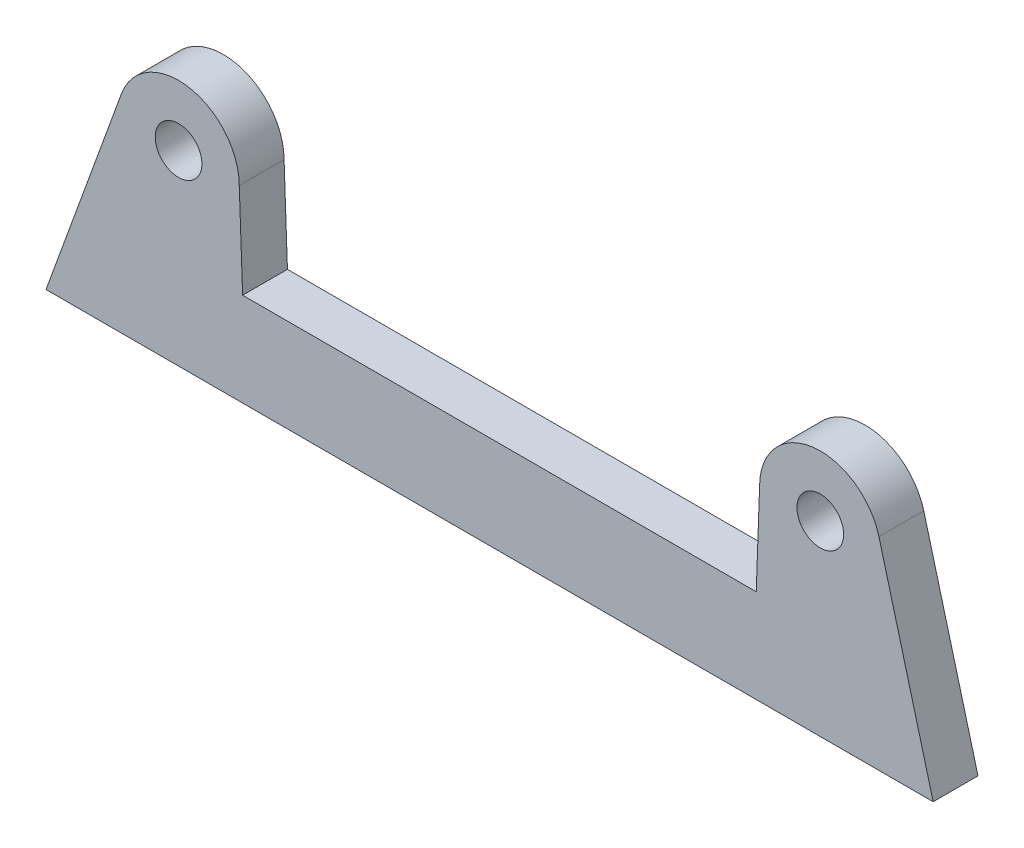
ISO-10303-21;
HEADER;
FILE_DESCRIPTION(('STEP AP214'),'2;1');
FILE_NAME('part.step','',(''),(''),'','','');
FILE_SCHEMA(('AUTOMOTIVE_DESIGN { 1 0 10303 214 1 1 1 1 }'));
ENDSEC;
DATA;
#1=APPLICATION_CONTEXT('core data for automotive mechanical design processes');
#2=APPLICATION_PROTOCOL_DEFINITION('international standard','automotive_design',2000,#1);
#3=PRODUCT_CONTEXT('',#1,'mechanical');
#4=PRODUCT('Part','Part','',(#3));
#5=PRODUCT_RELATED_PRODUCT_CATEGORY('part','',(#4));
#6=PRODUCT_DEFINITION_FORMATION('','',#4);
#7=PRODUCT_DEFINITION_CONTEXT('part definition',#1,'design');
#8=PRODUCT_DEFINITION('design','',#6,#7);
#9=PRODUCT_DEFINITION_SHAPE('','',#8);
#10=(LENGTH_UNIT() NAMED_UNIT(*) SI_UNIT(.MILLI.,.METRE.));
#11=(NAMED_UNIT(*) PLANE_ANGLE_UNIT() SI_UNIT($,.RADIAN.));
#12=(NAMED_UNIT(*) SI_UNIT($,.STERADIAN.) SOLID_ANGLE_UNIT());
#13=UNCERTAINTY_MEASURE_WITH_UNIT(LENGTH_MEASURE(1.E-05),#10,'distance_accuracy_value','');
#14=(GEOMETRIC_REPRESENTATION_CONTEXT(3) GLOBAL_UNCERTAINTY_ASSIGNED_CONTEXT((#13)) GLOBAL_UNIT_ASSIGNED_CONTEXT((#10,
#11,#12)) REPRESENTATION_CONTEXT('',''));
#15=CARTESIAN_POINT('',(0.,0.,0.));
#16=DIRECTION('',(0.,0.,1.));
#17=DIRECTION('',(1.,0.,0.));
#18=AXIS2_PLACEMENT_3D('',#15,#16,#17);
#19=CARTESIAN_POINT('',(10.2694788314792,28.2151611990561,-1154.21041919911));
#20=DIRECTION('',(-0.939692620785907,0.342020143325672,0.));
#21=DIRECTION('',(-0.342020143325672,-0.939692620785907,0.));
#22=AXIS2_PLACEMENT_3D('',#19,#20,#21);
#23=PLANE('',#22);
#24=DIRECTION('',(-0.342020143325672,-0.939692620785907,0.));
#25=VECTOR('',#24,1.);
#26=CARTESIAN_POINT('',(10.2694788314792,28.2151611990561,-1160.30641919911));
#27=LINE('',#26,#25);
#28=CARTESIAN_POINT('',(10.2694788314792,28.2151611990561,-1160.30641919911));
#29=VERTEX_POINT('',#28);
#30=CARTESIAN_POINT('',(0.,0.,-1160.30641919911));
#31=VERTEX_POINT('',#30);
#32=EDGE_CURVE('E131',#29,#31,#27,.T.);
#33=ORIENTED_EDGE('',*,*,#32,.T.);
#34=DIRECTION('',(0.,0.,-1.));
#35=VECTOR('',#34,1.);
#36=CARTESIAN_POINT('',(0.,0.,-1154.21041919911));
#37=LINE('',#36,#35);
#38=CARTESIAN_POINT('',(0.,0.,-1154.21041919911));
#39=VERTEX_POINT('',#38);
#40=EDGE_CURVE('E38',#39,#31,#37,.T.);
#41=ORIENTED_EDGE('',*,*,#40,.F.);
#42=DIRECTION('',(-0.342020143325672,-0.939692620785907,0.));
#43=VECTOR('',#42,1.);
#44=CARTESIAN_POINT('',(10.2694788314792,28.2151611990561,-1154.21041919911));
#45=LINE('',#44,#43);
#46=CARTESIAN_POINT('',(10.2694788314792,28.2151611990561,-1154.21041919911));
#47=VERTEX_POINT('',#46);
#48=EDGE_CURVE('E145',#47,#39,#45,.T.);
#49=ORIENTED_EDGE('',*,*,#48,.F.);
#50=DIRECTION('',(0.,0.,-1.));
#51=VECTOR('',#50,1.);
#52=CARTESIAN_POINT('',(10.2694788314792,28.2151611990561,-1154.21041919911));
#53=LINE('',#52,#51);
#54=EDGE_CURVE('E11',#47,#29,#53,.T.);
#55=ORIENTED_EDGE('',*,*,#54,.T.);
#56=EDGE_LOOP('',(#33,#41,#49,#55));
#57=FACE_BOUND('',#56,.T.);
#58=ADVANCED_FACE('F35',(#57),#23,.T.);
#59=CARTESIAN_POINT('',(18.0266414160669,25.3917849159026,-1154.21041919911));
#60=DIRECTION('',(0.,0.,-1.));
#61=DIRECTION('',(1.,0.,0.));
#62=AXIS2_PLACEMENT_3D('',#59,#60,#61);
#63=CYLINDRICAL_SURFACE('',#62,8.255);
#64=CARTESIAN_POINT('',(18.0266414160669,25.3917849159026,-1160.30641919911));
#65=DIRECTION('',(0.,0.,1.));
#66=DIRECTION('',(-1.,0.,0.));
#67=AXIS2_PLACEMENT_3D('',#64,#65,#66);
#68=CIRCLE('',#67,8.255);
#69=CARTESIAN_POINT('',(26.2816414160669,25.3917849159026,-1160.30641919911));
#70=VERTEX_POINT('',#69);
#71=EDGE_CURVE('E88',#70,#29,#68,.T.);
#72=ORIENTED_EDGE('',*,*,#71,.T.);
#73=ORIENTED_EDGE('',*,*,#54,.F.);
#74=CARTESIAN_POINT('',(18.0266414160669,25.3917849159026,-1154.21041919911));
#75=DIRECTION('',(0.,0.,1.));
#76=DIRECTION('',(-1.,0.,0.));
#77=AXIS2_PLACEMENT_3D('',#74,#75,#76);
#78=CIRCLE('',#77,8.255);
#79=CARTESIAN_POINT('',(26.2816414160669,25.3917849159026,-1154.21041919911));
#80=VERTEX_POINT('',#79);
#81=EDGE_CURVE('E53',#80,#47,#78,.T.);
#82=ORIENTED_EDGE('',*,*,#81,.F.);
#83=DIRECTION('',(0.,0.,-1.));
#84=VECTOR('',#83,1.);
#85=CARTESIAN_POINT('',(26.2816414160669,25.3917849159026,-1154.21041919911));
#86=LINE('',#85,#84);
#87=EDGE_CURVE('E44',#80,#70,#86,.T.);
#88=ORIENTED_EDGE('',*,*,#87,.T.);
#89=EDGE_LOOP('',(#72,#73,#82,#88));
#90=FACE_BOUND('',#89,.T.);
#91=ADVANCED_FACE('F214',(#90),#63,.T.);
#92=CARTESIAN_POINT('',(26.7383641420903,12.7,-1154.21041919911));
#93=DIRECTION('',(0.99935314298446,0.0359624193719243,0.));
#94=DIRECTION('',(-0.0359624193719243,0.99935314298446,0.));
#95=AXIS2_PLACEMENT_3D('',#92,#93,#94);
#96=PLANE('',#95);
#97=DIRECTION('',(-0.0359624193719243,0.99935314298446,0.));
#98=VECTOR('',#97,1.);
#99=CARTESIAN_POINT('',(26.7383641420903,12.7,-1160.30641919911));
#100=LINE('',#99,#98);
#101=CARTESIAN_POINT('',(26.7383641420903,12.7,-1160.30641919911));
#102=VERTEX_POINT('',#101);
#103=EDGE_CURVE('E82',#102,#70,#100,.T.);
#104=ORIENTED_EDGE('',*,*,#103,.T.);
#105=ORIENTED_EDGE('',*,*,#87,.F.);
#106=DIRECTION('',(-0.0359624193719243,0.99935314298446,0.));
#107=VECTOR('',#106,1.);
#108=CARTESIAN_POINT('',(26.7383641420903,12.7,-1154.21041919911));
#109=LINE('',#108,#107);
#110=CARTESIAN_POINT('',(26.7383641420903,12.7,-1154.21041919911));
#111=VERTEX_POINT('',#110);
#112=EDGE_CURVE('E113',#111,#80,#109,.T.);
#113=ORIENTED_EDGE('',*,*,#112,.F.);
#114=DIRECTION('',(0.,0.,-1.));
#115=VECTOR('',#114,1.);
#116=CARTESIAN_POINT('',(26.7383641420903,12.7,-1154.21041919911));
#117=LINE('',#116,#115);
#118=EDGE_CURVE('E120',#111,#102,#117,.T.);
#119=ORIENTED_EDGE('',*,*,#118,.T.);
#120=EDGE_LOOP('',(#104,#105,#113,#119));
#121=FACE_BOUND('',#120,.T.);
#122=ADVANCED_FACE('F126',(#121),#96,.T.);
#123=CARTESIAN_POINT('',(96.5883641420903,12.7,-1154.21041919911));
#124=DIRECTION('',(0.,1.,0.));
#125=DIRECTION('',(0.,0.,-1.));
#126=AXIS2_PLACEMENT_3D('',#123,#124,#125);
#127=PLANE('',#126);
#128=DIRECTION('',(-1.,0.,0.));
#129=VECTOR('',#128,1.);
#130=CARTESIAN_POINT('',(96.5883641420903,12.7,-1160.30641919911));
#131=LINE('',#130,#129);
#132=CARTESIAN_POINT('',(96.5883641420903,12.7,-1160.30641919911));
#133=VERTEX_POINT('',#132);
#134=EDGE_CURVE('E123',#133,#102,#131,.T.);
#135=ORIENTED_EDGE('',*,*,#134,.T.);
#136=ORIENTED_EDGE('',*,*,#118,.F.);
#137=DIRECTION('',(-1.,0.,0.));
#138=VECTOR('',#137,1.);
#139=CARTESIAN_POINT('',(96.5883641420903,12.7,-1154.21041919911));
#140=LINE('',#139,#138);
#141=CARTESIAN_POINT('',(96.5883641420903,12.7,-1154.21041919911));
#142=VERTEX_POINT('',#141);
#143=EDGE_CURVE('E109',#142,#111,#140,.T.);
#144=ORIENTED_EDGE('',*,*,#143,.F.);
#145=DIRECTION('',(0.,0.,-1.));
#146=VECTOR('',#145,1.);
#147=CARTESIAN_POINT('',(96.5883641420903,12.7,-1154.21041919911));
#148=LINE('',#147,#146);
#149=EDGE_CURVE('E124',#142,#133,#148,.T.);
#150=ORIENTED_EDGE('',*,*,#149,.T.);
#151=EDGE_LOOP('',(#135,#136,#144,#150));
#152=FACE_BOUND('',#151,.T.);
#153=ADVANCED_FACE('F121',(#152),#127,.T.);
#154=CARTESIAN_POINT('',(97.0450868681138,25.3917849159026,-1154.21041919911));
#155=DIRECTION('',(-0.99935314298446,0.0359624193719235,0.));
#156=DIRECTION('',(-0.0359624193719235,-0.99935314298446,0.));
#157=AXIS2_PLACEMENT_3D('',#154,#155,#156);
#158=PLANE('',#157);
#159=DIRECTION('',(-0.0359624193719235,-0.99935314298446,0.));
#160=VECTOR('',#159,1.);
#161=CARTESIAN_POINT('',(97.0450868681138,25.3917849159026,-1160.30641919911));
#162=LINE('',#161,#160);
#163=CARTESIAN_POINT('',(97.0450868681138,25.3917849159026,-1160.30641919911));
#164=VERTEX_POINT('',#163);
#165=EDGE_CURVE('E141',#164,#133,#162,.T.);
#166=ORIENTED_EDGE('',*,*,#165,.T.);
#167=ORIENTED_EDGE('',*,*,#149,.F.);
#168=DIRECTION('',(-0.0359624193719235,-0.99935314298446,0.));
#169=VECTOR('',#168,1.);
#170=CARTESIAN_POINT('',(97.0450868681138,25.3917849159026,-1154.21041919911));
#171=LINE('',#170,#169);
#172=CARTESIAN_POINT('',(97.0450868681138,25.3917849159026,-1154.21041919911));
#173=VERTEX_POINT('',#172);
#174=EDGE_CURVE('E115',#173,#142,#171,.T.);
#175=ORIENTED_EDGE('',*,*,#174,.F.);
#176=DIRECTION('',(0.,0.,-1.));
#177=VECTOR('',#176,1.);
#178=CARTESIAN_POINT('',(97.0450868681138,25.3917849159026,-1154.21041919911));
#179=LINE('',#178,#177);
#180=EDGE_CURVE('E149',#173,#164,#179,.T.);
#181=ORIENTED_EDGE('',*,*,#180,.T.);
#182=EDGE_LOOP('',(#166,#167,#175,#181));
#183=FACE_BOUND('',#182,.T.);
#184=ADVANCED_FACE('F225',(#183),#158,.T.);
#185=CARTESIAN_POINT('',(105.300086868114,25.3917849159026,-1154.21041919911));
#186=DIRECTION('',(0.,0.,-1.));
#187=DIRECTION('',(1.,0.,0.));
#188=AXIS2_PLACEMENT_3D('',#185,#186,#187);
#189=CYLINDRICAL_SURFACE('',#188,8.255);
#190=CARTESIAN_POINT('',(105.300086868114,25.3917849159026,-1160.30641919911));
#191=DIRECTION('',(0.,0.,1.));
#192=DIRECTION('',(1.,0.,0.));
#193=AXIS2_PLACEMENT_3D('',#190,#191,#192);
#194=CIRCLE('',#193,8.255);
#195=CARTESIAN_POINT('',(113.27380456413,27.528336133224,-1160.30641919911));
#196=VERTEX_POINT('',#195);
#197=EDGE_CURVE('E139',#196,#164,#194,.T.);
#198=ORIENTED_EDGE('',*,*,#197,.T.);
#199=ORIENTED_EDGE('',*,*,#180,.F.);
#200=CARTESIAN_POINT('',(105.300086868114,25.3917849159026,-1154.21041919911));
#201=DIRECTION('',(0.,0.,1.));
#202=DIRECTION('',(1.,0.,0.));
#203=AXIS2_PLACEMENT_3D('',#200,#201,#202);
#204=CIRCLE('',#203,8.255);
#205=CARTESIAN_POINT('',(113.27380456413,27.528336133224,-1154.21041919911));
#206=VERTEX_POINT('',#205);
#207=EDGE_CURVE('E174',#206,#173,#204,.T.);
#208=ORIENTED_EDGE('',*,*,#207,.F.);
#209=DIRECTION('',(0.,0.,-1.));
#210=VECTOR('',#209,1.);
#211=CARTESIAN_POINT('',(113.27380456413,27.528336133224,-1154.21041919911));
#212=LINE('',#211,#210);
#213=EDGE_CURVE('E152',#206,#196,#212,.T.);
#214=ORIENTED_EDGE('',*,*,#213,.T.);
#215=EDGE_LOOP('',(#198,#199,#208,#214));
#216=FACE_BOUND('',#215,.T.);
#217=ADVANCED_FACE('F172',(#216),#189,.T.);
#218=CARTESIAN_POINT('',(120.65,0.,-1154.21041919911));
#219=DIRECTION('',(0.965925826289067,0.258819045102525,0.));
#220=DIRECTION('',(-0.258819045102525,0.965925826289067,0.));
#221=AXIS2_PLACEMENT_3D('',#218,#219,#220);
#222=PLANE('',#221);
#223=DIRECTION('',(-0.258819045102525,0.965925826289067,0.));
#224=VECTOR('',#223,1.);
#225=CARTESIAN_POINT('',(120.65,0.,-1160.30641919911));
#226=LINE('',#225,#224);
#227=CARTESIAN_POINT('',(120.65,0.,-1160.30641919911));
#228=VERTEX_POINT('',#227);
#229=EDGE_CURVE('E137',#228,#196,#226,.T.);
#230=ORIENTED_EDGE('',*,*,#229,.T.);
#231=ORIENTED_EDGE('',*,*,#213,.F.);
#232=DIRECTION('',(-0.258819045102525,0.965925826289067,0.));
#233=VECTOR('',#232,1.);
#234=CARTESIAN_POINT('',(120.65,0.,-1154.21041919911));
#235=LINE('',#234,#233);
#236=CARTESIAN_POINT('',(120.65,0.,-1154.21041919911));
#237=VERTEX_POINT('',#236);
#238=EDGE_CURVE('E175',#237,#206,#235,.T.);
#239=ORIENTED_EDGE('',*,*,#238,.F.);
#240=DIRECTION('',(0.,0.,-1.));
#241=VECTOR('',#240,1.);
#242=CARTESIAN_POINT('',(120.65,0.,-1154.21041919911));
#243=LINE('',#242,#241);
#244=EDGE_CURVE('E154',#237,#228,#243,.T.);
#245=ORIENTED_EDGE('',*,*,#244,.T.);
#246=EDGE_LOOP('',(#230,#231,#239,#245));
#247=FACE_BOUND('',#246,.T.);
#248=ADVANCED_FACE('F169',(#247),#222,.T.);
#249=CARTESIAN_POINT('',(0.,0.,-1154.21041919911));
#250=DIRECTION('',(0.,-1.,0.));
#251=DIRECTION('',(0.,0.,1.));
#252=AXIS2_PLACEMENT_3D('',#249,#250,#251);
#253=PLANE('',#252);
#254=DIRECTION('',(1.,0.,0.));
#255=VECTOR('',#254,1.);
#256=CARTESIAN_POINT('',(0.,0.,-1160.30641919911));
#257=LINE('',#256,#255);
#258=EDGE_CURVE('E134',#31,#228,#257,.T.);
#259=ORIENTED_EDGE('',*,*,#258,.T.);
#260=ORIENTED_EDGE('',*,*,#244,.F.);
#261=DIRECTION('',(1.,0.,0.));
#262=VECTOR('',#261,1.);
#263=CARTESIAN_POINT('',(0.,0.,-1154.21041919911));
#264=LINE('',#263,#262);
#265=EDGE_CURVE('E96',#39,#237,#264,.T.);
#266=ORIENTED_EDGE('',*,*,#265,.F.);
#267=ORIENTED_EDGE('',*,*,#40,.T.);
#268=EDGE_LOOP('',(#259,#260,#266,#267));
#269=FACE_BOUND('',#268,.T.);
#270=ADVANCED_FACE('F160',(#269),#253,.T.);
#271=CARTESIAN_POINT('',(105.300086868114,25.3917849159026,-1154.21041919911));
#272=DIRECTION('',(0.,0.,-1.));
#273=DIRECTION('',(1.,0.,0.));
#274=AXIS2_PLACEMENT_3D('',#271,#272,#273);
#275=PLANE('',#274);
#276=CARTESIAN_POINT('',(105.300086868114,25.3917849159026,-1154.21041919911));
#277=DIRECTION('',(0.,0.,1.));
#278=DIRECTION('',(1.,0.,0.));
#279=AXIS2_PLACEMENT_3D('',#276,#277,#278);
#280=CIRCLE('',#279,3.175);
#281=CARTESIAN_POINT('',(108.475086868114,25.3917849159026,-1154.21041919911));
#282=VERTEX_POINT('',#281);
#283=EDGE_CURVE('E184',#282,#282,#280,.T.);
#284=ORIENTED_EDGE('',*,*,#283,.F.);
#285=EDGE_LOOP('',(#284));
#286=FACE_BOUND('',#285,.T.);
#287=CARTESIAN_POINT('',(18.0266414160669,25.3917849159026,-1154.21041919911));
#288=DIRECTION('',(0.,0.,1.));
#289=DIRECTION('',(1.,0.,0.));
#290=AXIS2_PLACEMENT_3D('',#287,#288,#289);
#291=CIRCLE('',#290,3.175);
#292=CARTESIAN_POINT('',(21.2016414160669,25.3917849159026,-1154.21041919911));
#293=VERTEX_POINT('',#292);
#294=EDGE_CURVE('E135',#293,#293,#291,.T.);
#295=ORIENTED_EDGE('',*,*,#294,.F.);
#296=EDGE_LOOP('',(#295));
#297=FACE_BOUND('',#296,.T.);
#298=ORIENTED_EDGE('',*,*,#48,.T.);
#299=ORIENTED_EDGE('',*,*,#265,.T.);
#300=ORIENTED_EDGE('',*,*,#238,.T.);
#301=ORIENTED_EDGE('',*,*,#207,.T.);
#302=ORIENTED_EDGE('',*,*,#174,.T.);
#303=ORIENTED_EDGE('',*,*,#143,.T.);
#304=ORIENTED_EDGE('',*,*,#112,.T.);
#305=ORIENTED_EDGE('',*,*,#81,.T.);
#306=EDGE_LOOP('',(#298,#299,#300,#301,#302,#303,#304,#305));
#307=FACE_BOUND('',#306,.T.);
#308=ADVANCED_FACE('F111',(#286,#297,#307),#275,.F.);
#309=CARTESIAN_POINT('',(105.300086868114,25.3917849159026,-1160.30641919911));
#310=DIRECTION('',(0.,0.,-1.));
#311=DIRECTION('',(1.,0.,0.));
#312=AXIS2_PLACEMENT_3D('',#309,#310,#311);
#313=PLANE('',#312);
#314=CARTESIAN_POINT('',(105.300086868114,25.3917849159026,-1160.30641919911));
#315=DIRECTION('',(0.,0.,1.));
#316=DIRECTION('',(1.,0.,0.));
#317=AXIS2_PLACEMENT_3D('',#314,#315,#316);
#318=CIRCLE('',#317,3.175);
#319=CARTESIAN_POINT('',(108.475086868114,25.3917849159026,-1160.30641919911));
#320=VERTEX_POINT('',#319);
#321=EDGE_CURVE('E187',#320,#320,#318,.T.);
#322=ORIENTED_EDGE('',*,*,#321,.T.);
#323=EDGE_LOOP('',(#322));
#324=FACE_BOUND('',#323,.T.);
#325=CARTESIAN_POINT('',(18.0266414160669,25.3917849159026,-1160.30641919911));
#326=DIRECTION('',(0.,0.,1.));
#327=DIRECTION('',(1.,0.,0.));
#328=AXIS2_PLACEMENT_3D('',#325,#326,#327);
#329=CIRCLE('',#328,3.175);
#330=CARTESIAN_POINT('',(21.2016414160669,25.3917849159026,-1160.30641919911));
#331=VERTEX_POINT('',#330);
#332=EDGE_CURVE('E181',#331,#331,#329,.T.);
#333=ORIENTED_EDGE('',*,*,#332,.T.);
#334=EDGE_LOOP('',(#333));
#335=FACE_BOUND('',#334,.T.);
#336=ORIENTED_EDGE('',*,*,#32,.F.);
#337=ORIENTED_EDGE('',*,*,#71,.F.);
#338=ORIENTED_EDGE('',*,*,#103,.F.);
#339=ORIENTED_EDGE('',*,*,#134,.F.);
#340=ORIENTED_EDGE('',*,*,#165,.F.);
#341=ORIENTED_EDGE('',*,*,#197,.F.);
#342=ORIENTED_EDGE('',*,*,#229,.F.);
#343=ORIENTED_EDGE('',*,*,#258,.F.);
#344=EDGE_LOOP('',(#336,#337,#338,#339,#340,#341,#342,#343));
#345=FACE_BOUND('',#344,.T.);
#346=ADVANCED_FACE('F165',(#324,#335,#345),#313,.T.);
#347=CARTESIAN_POINT('',(18.0266414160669,25.3917849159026,-1154.21041919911));
#348=DIRECTION('',(0.,0.,-1.));
#349=DIRECTION('',(1.,0.,0.));
#350=AXIS2_PLACEMENT_3D('',#347,#348,#349);
#351=CYLINDRICAL_SURFACE('',#350,3.175);
#352=CARTESIAN_POINT('',(21.2016414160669,25.3917849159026,-1154.21041919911));
#353=CARTESIAN_POINT('',(21.2016414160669,25.3917849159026,-1154.27391919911));
#354=CARTESIAN_POINT('',(21.2016414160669,25.3917849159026,-1154.33741919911));
#355=CARTESIAN_POINT('',(21.2016414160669,25.3917849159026,-1154.46441919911));
#356=CARTESIAN_POINT('',(21.2016414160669,25.3917849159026,-1154.52791919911));
#357=CARTESIAN_POINT('',(21.2016414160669,25.3917849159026,-1154.65491919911));
#358=CARTESIAN_POINT('',(21.2016414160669,25.3917849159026,-1154.71841919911));
#359=CARTESIAN_POINT('',(21.2016414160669,25.3917849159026,-1154.84541919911));
#360=CARTESIAN_POINT('',(21.2016414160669,25.3917849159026,-1154.90891919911));
#361=CARTESIAN_POINT('',(21.2016414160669,25.3917849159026,-1155.03591919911));
#362=CARTESIAN_POINT('',(21.2016414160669,25.3917849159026,-1155.09941919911));
#363=CARTESIAN_POINT('',(21.2016414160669,25.3917849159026,-1155.22641919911));
#364=CARTESIAN_POINT('',(21.2016414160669,25.3917849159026,-1155.28991919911));
#365=CARTESIAN_POINT('',(21.2016414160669,25.3917849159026,-1155.41691919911));
#366=CARTESIAN_POINT('',(21.2016414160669,25.3917849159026,-1155.48041919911));
#367=CARTESIAN_POINT('',(21.2016414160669,25.3917849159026,-1155.60741919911));
#368=CARTESIAN_POINT('',(21.2016414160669,25.3917849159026,-1155.67091919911));
#369=CARTESIAN_POINT('',(21.2016414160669,25.3917849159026,-1155.79791919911));
#370=CARTESIAN_POINT('',(21.2016414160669,25.3917849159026,-1155.86141919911));
#371=CARTESIAN_POINT('',(21.2016414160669,25.3917849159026,-1155.98841919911));
#372=CARTESIAN_POINT('',(21.2016414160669,25.3917849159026,-1156.05191919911));
#373=CARTESIAN_POINT('',(21.2016414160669,25.3917849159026,-1156.17891919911));
#374=CARTESIAN_POINT('',(21.2016414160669,25.3917849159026,-1156.24241919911));
#375=CARTESIAN_POINT('',(21.2016414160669,25.3917849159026,-1156.36941919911));
#376=CARTESIAN_POINT('',(21.2016414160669,25.3917849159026,-1156.43291919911));
#377=CARTESIAN_POINT('',(21.2016414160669,25.3917849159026,-1156.55991919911));
#378=CARTESIAN_POINT('',(21.2016414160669,25.3917849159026,-1156.62341919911));
#379=CARTESIAN_POINT('',(21.2016414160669,25.3917849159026,-1156.75041919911));
#380=CARTESIAN_POINT('',(21.2016414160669,25.3917849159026,-1156.81391919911));
#381=CARTESIAN_POINT('',(21.2016414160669,25.3917849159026,-1156.94091919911));
#382=CARTESIAN_POINT('',(21.2016414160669,25.3917849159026,-1157.00441919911));
#383=CARTESIAN_POINT('',(21.2016414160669,25.3917849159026,-1157.13141919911));
#384=CARTESIAN_POINT('',(21.2016414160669,25.3917849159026,-1157.19491919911));
#385=CARTESIAN_POINT('',(21.2016414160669,25.3917849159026,-1157.32191919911));
#386=CARTESIAN_POINT('',(21.2016414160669,25.3917849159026,-1157.38541919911));
#387=CARTESIAN_POINT('',(21.2016414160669,25.3917849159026,-1157.51241919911));
#388=CARTESIAN_POINT('',(21.2016414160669,25.3917849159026,-1157.57591919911));
#389=CARTESIAN_POINT('',(21.2016414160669,25.3917849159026,-1157.70291919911));
#390=CARTESIAN_POINT('',(21.2016414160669,25.3917849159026,-1157.76641919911));
#391=CARTESIAN_POINT('',(21.2016414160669,25.3917849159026,-1157.89341919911));
#392=CARTESIAN_POINT('',(21.2016414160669,25.3917849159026,-1157.95691919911));
#393=CARTESIAN_POINT('',(21.2016414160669,25.3917849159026,-1158.08391919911));
#394=CARTESIAN_POINT('',(21.2016414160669,25.3917849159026,-1158.14741919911));
#395=CARTESIAN_POINT('',(21.2016414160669,25.3917849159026,-1158.27441919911));
#396=CARTESIAN_POINT('',(21.2016414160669,25.3917849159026,-1158.33791919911));
#397=CARTESIAN_POINT('',(21.2016414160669,25.3917849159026,-1158.46491919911));
#398=CARTESIAN_POINT('',(21.2016414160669,25.3917849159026,-1158.52841919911));
#399=CARTESIAN_POINT('',(21.2016414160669,25.3917849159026,-1158.65541919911));
#400=CARTESIAN_POINT('',(21.2016414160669,25.3917849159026,-1158.71891919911));
#401=CARTESIAN_POINT('',(21.2016414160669,25.3917849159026,-1158.84591919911));
#402=CARTESIAN_POINT('',(21.2016414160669,25.3917849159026,-1158.90941919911));
#403=CARTESIAN_POINT('',(21.2016414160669,25.3917849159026,-1159.03641919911));
#404=CARTESIAN_POINT('',(21.2016414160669,25.3917849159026,-1159.09991919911));
#405=CARTESIAN_POINT('',(21.2016414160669,25.3917849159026,-1159.22691919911));
#406=CARTESIAN_POINT('',(21.2016414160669,25.3917849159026,-1159.29041919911));
#407=CARTESIAN_POINT('',(21.2016414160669,25.3917849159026,-1159.41741919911));
#408=CARTESIAN_POINT('',(21.2016414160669,25.3917849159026,-1159.48091919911));
#409=CARTESIAN_POINT('',(21.2016414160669,25.3917849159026,-1159.60791919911));
#410=CARTESIAN_POINT('',(21.2016414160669,25.3917849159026,-1159.67141919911));
#411=CARTESIAN_POINT('',(21.2016414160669,25.3917849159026,-1159.79841919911));
#412=CARTESIAN_POINT('',(21.2016414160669,25.3917849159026,-1159.86191919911));
#413=CARTESIAN_POINT('',(21.2016414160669,25.3917849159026,-1159.98891919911));
#414=CARTESIAN_POINT('',(21.2016414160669,25.3917849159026,-1160.05241919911));
#415=CARTESIAN_POINT('',(21.2016414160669,25.3917849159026,-1160.17941919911));
#416=CARTESIAN_POINT('',(21.2016414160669,25.3917849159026,-1160.24291919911));
#417=CARTESIAN_POINT('',(21.2016414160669,25.3917849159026,-1160.30641919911));
#418=B_SPLINE_CURVE_WITH_KNOTS('',3,(#352,#353,#354,#355,#356,#357,#358,#359,#360,#361,#362,
#363,#364,#365,#366,#367,#368,#369,#370,#371,#372,#373,#374,#375,#376,#377,#378,#379,#380,#381,
#382,#383,#384,#385,#386,#387,#388,#389,#390,#391,#392,#393,#394,#395,#396,#397,#398,#399,#400,
#401,#402,#403,#404,#405,#406,#407,#408,#409,#410,#411,#412,#413,#414,#415,#416,#417),
.UNSPECIFIED.,.F.,.F.,(4,2,2,2,2,2,2,2,2,2,2,2,2,2,2,2,2,2,2,2,2,2,2,2,2,2,2,2,2,2,2,2,4),(0.,
0.190500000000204,0.381000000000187,0.571500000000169,0.762000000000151,0.952500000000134,
1.14300000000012,1.3335000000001,1.52400000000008,1.71450000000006,1.90500000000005,
2.09550000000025,2.28600000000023,2.47650000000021,2.6670000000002,2.85750000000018,
3.04800000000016,3.23850000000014,3.42900000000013,3.61950000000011,3.81000000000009,
4.00050000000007,4.19100000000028,4.38150000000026,4.57200000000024,4.76250000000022,
4.95300000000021,5.14350000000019,5.33400000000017,5.52450000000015,5.71500000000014,
5.90550000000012,6.0960000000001),.UNSPECIFIED.);
#419=EDGE_CURVE('BSEAM201',#293,#331,#418,.T.);
#420=ORIENTED_EDGE('',*,*,#294,.T.);
#421=ORIENTED_EDGE('',*,*,#332,.F.);
#422=ORIENTED_EDGE('',*,*,#419,.T.);
#423=ORIENTED_EDGE('',*,*,#419,.F.);
#424=EDGE_LOOP('',(#420,#422,#421,#423));
#425=FACE_BOUND('',#424,.T.);
#426=ADVANCED_FACE('F201',(#425),#351,.F.);
#427=CARTESIAN_POINT('',(105.300086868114,25.3917849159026,-1154.21041919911));
#428=DIRECTION('',(0.,0.,-1.));
#429=DIRECTION('',(1.,0.,0.));
#430=AXIS2_PLACEMENT_3D('',#427,#428,#429);
#431=CYLINDRICAL_SURFACE('',#430,3.175);
#432=CARTESIAN_POINT('',(108.475086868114,25.3917849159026,-1154.21041919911));
#433=CARTESIAN_POINT('',(108.475086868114,25.3917849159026,-1154.27391919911));
#434=CARTESIAN_POINT('',(108.475086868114,25.3917849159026,-1154.33741919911));
#435=CARTESIAN_POINT('',(108.475086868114,25.3917849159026,-1154.46441919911));
#436=CARTESIAN_POINT('',(108.475086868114,25.3917849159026,-1154.52791919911));
#437=CARTESIAN_POINT('',(108.475086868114,25.3917849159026,-1154.65491919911));
#438=CARTESIAN_POINT('',(108.475086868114,25.3917849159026,-1154.71841919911));
#439=CARTESIAN_POINT('',(108.475086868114,25.3917849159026,-1154.84541919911));
#440=CARTESIAN_POINT('',(108.475086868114,25.3917849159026,-1154.90891919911));
#441=CARTESIAN_POINT('',(108.475086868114,25.3917849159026,-1155.03591919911));
#442=CARTESIAN_POINT('',(108.475086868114,25.3917849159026,-1155.09941919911));
#443=CARTESIAN_POINT('',(108.475086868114,25.3917849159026,-1155.22641919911));
#444=CARTESIAN_POINT('',(108.475086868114,25.3917849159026,-1155.28991919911));
#445=CARTESIAN_POINT('',(108.475086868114,25.3917849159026,-1155.41691919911));
#446=CARTESIAN_POINT('',(108.475086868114,25.3917849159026,-1155.48041919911));
#447=CARTESIAN_POINT('',(108.475086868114,25.3917849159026,-1155.60741919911));
#448=CARTESIAN_POINT('',(108.475086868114,25.3917849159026,-1155.67091919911));
#449=CARTESIAN_POINT('',(108.475086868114,25.3917849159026,-1155.79791919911));
#450=CARTESIAN_POINT('',(108.475086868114,25.3917849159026,-1155.86141919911));
#451=CARTESIAN_POINT('',(108.475086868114,25.3917849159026,-1155.98841919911));
#452=CARTESIAN_POINT('',(108.475086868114,25.3917849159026,-1156.05191919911));
#453=CARTESIAN_POINT('',(108.475086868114,25.3917849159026,-1156.17891919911));
#454=CARTESIAN_POINT('',(108.475086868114,25.3917849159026,-1156.24241919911));
#455=CARTESIAN_POINT('',(108.475086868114,25.3917849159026,-1156.36941919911));
#456=CARTESIAN_POINT('',(108.475086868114,25.3917849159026,-1156.43291919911));
#457=CARTESIAN_POINT('',(108.475086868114,25.3917849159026,-1156.55991919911));
#458=CARTESIAN_POINT('',(108.475086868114,25.3917849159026,-1156.62341919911));
#459=CARTESIAN_POINT('',(108.475086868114,25.3917849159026,-1156.75041919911));
#460=CARTESIAN_POINT('',(108.475086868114,25.3917849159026,-1156.81391919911));
#461=CARTESIAN_POINT('',(108.475086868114,25.3917849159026,-1156.94091919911));
#462=CARTESIAN_POINT('',(108.475086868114,25.3917849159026,-1157.00441919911));
#463=CARTESIAN_POINT('',(108.475086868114,25.3917849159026,-1157.13141919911));
#464=CARTESIAN_POINT('',(108.475086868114,25.3917849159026,-1157.19491919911));
#465=CARTESIAN_POINT('',(108.475086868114,25.3917849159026,-1157.32191919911));
#466=CARTESIAN_POINT('',(108.475086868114,25.3917849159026,-1157.38541919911));
#467=CARTESIAN_POINT('',(108.475086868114,25.3917849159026,-1157.51241919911));
#468=CARTESIAN_POINT('',(108.475086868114,25.3917849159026,-1157.57591919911));
#469=CARTESIAN_POINT('',(108.475086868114,25.3917849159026,-1157.70291919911));
#470=CARTESIAN_POINT('',(108.475086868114,25.3917849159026,-1157.76641919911));
#471=CARTESIAN_POINT('',(108.475086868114,25.3917849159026,-1157.89341919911));
#472=CARTESIAN_POINT('',(108.475086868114,25.3917849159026,-1157.95691919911));
#473=CARTESIAN_POINT('',(108.475086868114,25.3917849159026,-1158.08391919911));
#474=CARTESIAN_POINT('',(108.475086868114,25.3917849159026,-1158.14741919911));
#475=CARTESIAN_POINT('',(108.475086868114,25.3917849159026,-1158.27441919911));
#476=CARTESIAN_POINT('',(108.475086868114,25.3917849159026,-1158.33791919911));
#477=CARTESIAN_POINT('',(108.475086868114,25.3917849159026,-1158.46491919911));
#478=CARTESIAN_POINT('',(108.475086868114,25.3917849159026,-1158.52841919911));
#479=CARTESIAN_POINT('',(108.475086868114,25.3917849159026,-1158.65541919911));
#480=CARTESIAN_POINT('',(108.475086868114,25.3917849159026,-1158.71891919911));
#481=CARTESIAN_POINT('',(108.475086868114,25.3917849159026,-1158.84591919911));
#482=CARTESIAN_POINT('',(108.475086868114,25.3917849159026,-1158.90941919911));
#483=CARTESIAN_POINT('',(108.475086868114,25.3917849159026,-1159.03641919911));
#484=CARTESIAN_POINT('',(108.475086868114,25.3917849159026,-1159.09991919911));
#485=CARTESIAN_POINT('',(108.475086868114,25.3917849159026,-1159.22691919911));
#486=CARTESIAN_POINT('',(108.475086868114,25.3917849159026,-1159.29041919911));
#487=CARTESIAN_POINT('',(108.475086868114,25.3917849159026,-1159.41741919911));
#488=CARTESIAN_POINT('',(108.475086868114,25.3917849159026,-1159.48091919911));
#489=CARTESIAN_POINT('',(108.475086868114,25.3917849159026,-1159.60791919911));
#490=CARTESIAN_POINT('',(108.475086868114,25.3917849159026,-1159.67141919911));
#491=CARTESIAN_POINT('',(108.475086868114,25.3917849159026,-1159.79841919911));
#492=CARTESIAN_POINT('',(108.475086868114,25.3917849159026,-1159.86191919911));
#493=CARTESIAN_POINT('',(108.475086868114,25.3917849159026,-1159.98891919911));
#494=CARTESIAN_POINT('',(108.475086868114,25.3917849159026,-1160.05241919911));
#495=CARTESIAN_POINT('',(108.475086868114,25.3917849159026,-1160.17941919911));
#496=CARTESIAN_POINT('',(108.475086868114,25.3917849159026,-1160.24291919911));
#497=CARTESIAN_POINT('',(108.475086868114,25.3917849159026,-1160.30641919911));
#498=B_SPLINE_CURVE_WITH_KNOTS('',3,(#432,#433,#434,#435,#436,#437,#438,#439,#440,#441,#442,
#443,#444,#445,#446,#447,#448,#449,#450,#451,#452,#453,#454,#455,#456,#457,#458,#459,#460,#461,
#462,#463,#464,#465,#466,#467,#468,#469,#470,#471,#472,#473,#474,#475,#476,#477,#478,#479,#480,
#481,#482,#483,#484,#485,#486,#487,#488,#489,#490,#491,#492,#493,#494,#495,#496,#497),
.UNSPECIFIED.,.F.,.F.,(4,2,2,2,2,2,2,2,2,2,2,2,2,2,2,2,2,2,2,2,2,2,2,2,2,2,2,2,2,2,2,2,4),(0.,
0.190500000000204,0.381000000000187,0.571500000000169,0.762000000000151,0.952500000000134,
1.14300000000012,1.3335000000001,1.52400000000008,1.71450000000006,1.90500000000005,
2.09550000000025,2.28600000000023,2.47650000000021,2.6670000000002,2.85750000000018,
3.04800000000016,3.23850000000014,3.42900000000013,3.61950000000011,3.81000000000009,
4.00050000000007,4.19100000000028,4.38150000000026,4.57200000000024,4.76250000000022,
4.95300000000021,5.14350000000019,5.33400000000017,5.52450000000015,5.71500000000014,
5.90550000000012,6.0960000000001),.UNSPECIFIED.);
#499=EDGE_CURVE('BSEAM193',#282,#320,#498,.T.);
#500=ORIENTED_EDGE('',*,*,#283,.T.);
#501=ORIENTED_EDGE('',*,*,#321,.F.);
#502=ORIENTED_EDGE('',*,*,#499,.T.);
#503=ORIENTED_EDGE('',*,*,#499,.F.);
#504=EDGE_LOOP('',(#500,#502,#501,#503));
#505=FACE_BOUND('',#504,.T.);
#506=ADVANCED_FACE('F193',(#505),#431,.F.);
#507=CLOSED_SHELL('',(#58,#91,#122,#153,#184,#217,#248,#270,#308,#346,#426,#506));
#508=MANIFOLD_SOLID_BREP('B2',#507);
#509=ADVANCED_BREP_SHAPE_REPRESENTATION('',(#18,#508),#14);
#510=SHAPE_DEFINITION_REPRESENTATION(#9,#509);
ENDSEC;
END-ISO-10303-21;
